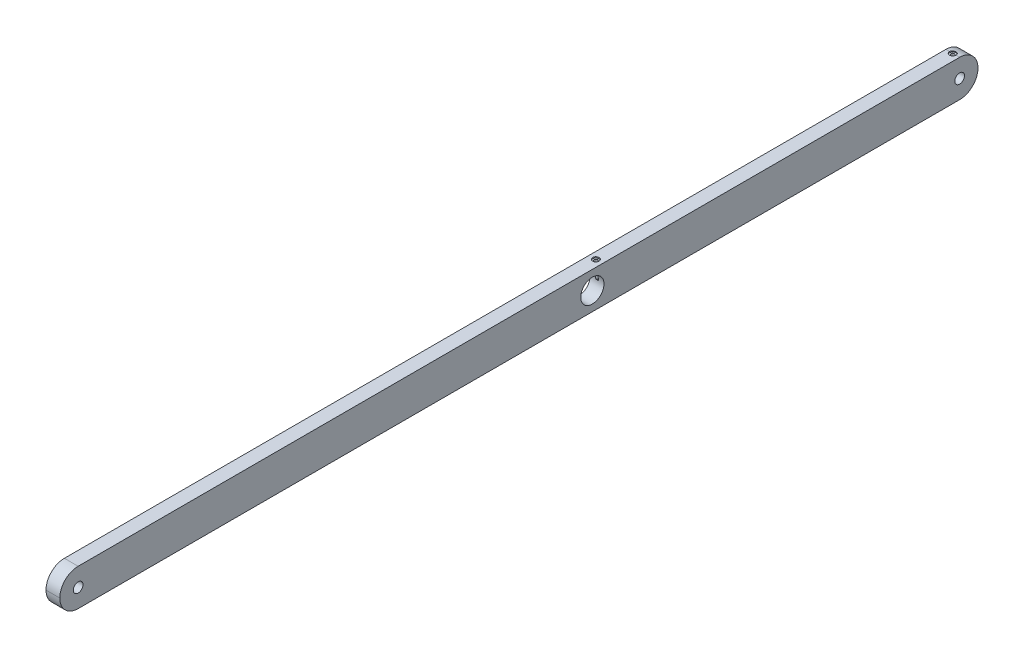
ISO-10303-21;
HEADER;
FILE_DESCRIPTION(('STEP AP214'),'2;1');
FILE_NAME('part.step','',(''),(''),'','','');
FILE_SCHEMA(('AUTOMOTIVE_DESIGN { 1 0 10303 214 1 1 1 1 }'));
ENDSEC;
DATA;
#1=APPLICATION_CONTEXT('core data for automotive mechanical design processes');
#2=APPLICATION_PROTOCOL_DEFINITION('international standard','automotive_design',2000,#1);
#3=PRODUCT_CONTEXT('',#1,'mechanical');
#4=PRODUCT('Part','Part','',(#3));
#5=PRODUCT_RELATED_PRODUCT_CATEGORY('part','',(#4));
#6=PRODUCT_DEFINITION_FORMATION('','',#4);
#7=PRODUCT_DEFINITION_CONTEXT('part definition',#1,'design');
#8=PRODUCT_DEFINITION('design','',#6,#7);
#9=PRODUCT_DEFINITION_SHAPE('','',#8);
#10=(LENGTH_UNIT() NAMED_UNIT(*) SI_UNIT(.MILLI.,.METRE.));
#11=(NAMED_UNIT(*) PLANE_ANGLE_UNIT() SI_UNIT($,.RADIAN.));
#12=(NAMED_UNIT(*) SI_UNIT($,.STERADIAN.) SOLID_ANGLE_UNIT());
#13=UNCERTAINTY_MEASURE_WITH_UNIT(LENGTH_MEASURE(1.E-05),#10,'distance_accuracy_value','');
#14=(GEOMETRIC_REPRESENTATION_CONTEXT(3) GLOBAL_UNCERTAINTY_ASSIGNED_CONTEXT((#13)) GLOBAL_UNIT_ASSIGNED_CONTEXT((#10,
#11,#12)) REPRESENTATION_CONTEXT('',''));
#15=CARTESIAN_POINT('',(0.,0.,0.));
#16=DIRECTION('',(0.,0.,1.));
#17=DIRECTION('',(1.,0.,0.));
#18=AXIS2_PLACEMENT_3D('',#15,#16,#17);
#19=CARTESIAN_POINT('',(9.525,0.,1219.2));
#20=DIRECTION('',(-1.,0.,0.));
#21=DIRECTION('',(0.,0.,1.));
#22=AXIS2_PLACEMENT_3D('',#19,#20,#21);
#23=CYLINDRICAL_SURFACE('',#22,25.4);
#24=DIRECTION('',(-1.,0.,0.));
#25=VECTOR('',#24,1.);
#26=CARTESIAN_POINT('',(9.525,0.,1244.6));
#27=LINE('',#26,#25);
#28=CARTESIAN_POINT('',(-9.525,0.,1244.6));
#29=VERTEX_POINT('',#28);
#30=CARTESIAN_POINT('',(9.525,0.,1244.6));
#31=VERTEX_POINT('',#30);
#32=EDGE_CURVE('E172',#29,#31,#27,.F.);
#33=ORIENTED_EDGE('',*,*,#32,.F.);
#34=CARTESIAN_POINT('',(-9.525,0.,1219.2));
#35=DIRECTION('',(1.,0.,0.));
#36=DIRECTION('',(0.,0.,-1.));
#37=AXIS2_PLACEMENT_3D('',#34,#35,#36);
#38=CIRCLE('',#37,25.4);
#39=CARTESIAN_POINT('',(-9.525,-25.4,1219.2));
#40=VERTEX_POINT('',#39);
#41=EDGE_CURVE('E136',#29,#40,#38,.T.);
#42=ORIENTED_EDGE('',*,*,#41,.T.);
#43=DIRECTION('',(-1.,0.,0.));
#44=VECTOR('',#43,1.);
#45=CARTESIAN_POINT('',(9.525,-25.4,1219.2));
#46=LINE('',#45,#44);
#47=CARTESIAN_POINT('',(9.525,-25.4,1219.2));
#48=VERTEX_POINT('',#47);
#49=EDGE_CURVE('E169',#48,#40,#46,.T.);
#50=ORIENTED_EDGE('',*,*,#49,.F.);
#51=CARTESIAN_POINT('',(9.525,0.,1219.2));
#52=DIRECTION('',(1.,0.,0.));
#53=DIRECTION('',(0.,0.,-1.));
#54=AXIS2_PLACEMENT_3D('',#51,#52,#53);
#55=CIRCLE('',#54,25.4);
#56=EDGE_CURVE('E143',#31,#48,#55,.T.);
#57=ORIENTED_EDGE('',*,*,#56,.F.);
#58=EDGE_LOOP('',(#33,#42,#50,#57));
#59=FACE_BOUND('',#58,.T.);
#60=ADVANCED_FACE('F36',(#59),#23,.T.);
#61=CARTESIAN_POINT('',(9.525,0.,1219.2));
#62=DIRECTION('',(1.,0.,0.));
#63=DIRECTION('',(0.,0.,-1.));
#64=AXIS2_PLACEMENT_3D('',#61,#62,#63);
#65=PLANE('',#64);
#66=CARTESIAN_POINT('',(9.525,0.,1219.2));
#67=DIRECTION('',(1.,0.,0.));
#68=DIRECTION('',(0.,0.,-1.));
#69=AXIS2_PLACEMENT_3D('',#66,#67,#68);
#70=CIRCLE('',#69,6.73100000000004);
#71=CARTESIAN_POINT('',(9.525,0.,1225.931));
#72=VERTEX_POINT('',#71);
#73=EDGE_CURVE('E127',#72,#72,#70,.T.);
#74=ORIENTED_EDGE('',*,*,#73,.F.);
#75=EDGE_LOOP('',(#74));
#76=FACE_BOUND('',#75,.T.);
#77=CARTESIAN_POINT('',(9.525,25.4,1219.2));
#78=VERTEX_POINT('',#77);
#79=EDGE_CURVE('E139',#78,#31,#55,.T.);
#80=ORIENTED_EDGE('',*,*,#79,.T.);
#81=ORIENTED_EDGE('',*,*,#56,.T.);
#82=DIRECTION('',(0.,0.,-1.));
#83=VECTOR('',#82,1.);
#84=CARTESIAN_POINT('',(9.525,-25.4,1219.2));
#85=LINE('',#84,#83);
#86=CARTESIAN_POINT('',(9.525,-25.4,0.));
#87=VERTEX_POINT('',#86);
#88=EDGE_CURVE('E142',#48,#87,#85,.T.);
#89=ORIENTED_EDGE('',*,*,#88,.T.);
#90=CARTESIAN_POINT('',(9.525,0.,0.));
#91=DIRECTION('',(1.,0.,0.));
#92=DIRECTION('',(0.,0.,-1.));
#93=AXIS2_PLACEMENT_3D('',#90,#91,#92);
#94=CIRCLE('',#93,25.4);
#95=CARTESIAN_POINT('',(9.525,25.4,0.));
#96=VERTEX_POINT('',#95);
#97=EDGE_CURVE('E145',#87,#96,#94,.T.);
#98=ORIENTED_EDGE('',*,*,#97,.T.);
#99=DIRECTION('',(0.,0.,1.));
#100=VECTOR('',#99,1.);
#101=CARTESIAN_POINT('',(9.525,25.4,1219.2));
#102=LINE('',#101,#100);
#103=EDGE_CURVE('E147',#96,#78,#102,.T.);
#104=ORIENTED_EDGE('',*,*,#103,.T.);
#105=EDGE_LOOP('',(#80,#81,#89,#98,#104));
#106=FACE_BOUND('',#105,.T.);
#107=CARTESIAN_POINT('',(9.525,0.,0.));
#108=DIRECTION('',(1.,0.,0.));
#109=DIRECTION('',(0.,0.,-1.));
#110=AXIS2_PLACEMENT_3D('',#107,#108,#109);
#111=CIRCLE('',#110,6.731);
#112=CARTESIAN_POINT('',(9.525,0.,-6.731));
#113=VERTEX_POINT('',#112);
#114=EDGE_CURVE('E133',#113,#113,#111,.T.);
#115=ORIENTED_EDGE('',*,*,#114,.F.);
#116=EDGE_LOOP('',(#115));
#117=FACE_BOUND('',#116,.T.);
#118=CARTESIAN_POINT('',(9.525,0.,508.));
#119=DIRECTION('',(1.,0.,0.));
#120=DIRECTION('',(0.,0.,-1.));
#121=AXIS2_PLACEMENT_3D('',#118,#119,#120);
#122=CIRCLE('',#121,16.0655);
#123=CARTESIAN_POINT('',(9.525,0.,491.9345));
#124=VERTEX_POINT('',#123);
#125=EDGE_CURVE('E116',#124,#124,#122,.T.);
#126=ORIENTED_EDGE('',*,*,#125,.F.);
#127=EDGE_LOOP('',(#126));
#128=FACE_BOUND('',#127,.T.);
#129=ADVANCED_FACE('F227',(#76,#106,#117,#128),#65,.T.);
#130=CARTESIAN_POINT('',(-9.525,0.,1219.2));
#131=DIRECTION('',(1.,0.,0.));
#132=DIRECTION('',(0.,0.,-1.));
#133=AXIS2_PLACEMENT_3D('',#130,#131,#132);
#134=PLANE('',#133);
#135=CARTESIAN_POINT('',(-9.525,25.4,1219.2));
#136=VERTEX_POINT('',#135);
#137=EDGE_CURVE('E150',#136,#29,#38,.T.);
#138=ORIENTED_EDGE('',*,*,#137,.F.);
#139=DIRECTION('',(0.,0.,1.));
#140=VECTOR('',#139,1.);
#141=CARTESIAN_POINT('',(-9.525,25.4,1219.2));
#142=LINE('',#141,#140);
#143=CARTESIAN_POINT('',(-9.525,25.4,0.));
#144=VERTEX_POINT('',#143);
#145=EDGE_CURVE('E158',#144,#136,#142,.T.);
#146=ORIENTED_EDGE('',*,*,#145,.F.);
#147=CARTESIAN_POINT('',(-9.525,0.,0.));
#148=DIRECTION('',(1.,0.,0.));
#149=DIRECTION('',(0.,0.,-1.));
#150=AXIS2_PLACEMENT_3D('',#147,#148,#149);
#151=CIRCLE('',#150,25.4);
#152=CARTESIAN_POINT('',(-9.525,-25.4,0.));
#153=VERTEX_POINT('',#152);
#154=EDGE_CURVE('E155',#153,#144,#151,.T.);
#155=ORIENTED_EDGE('',*,*,#154,.F.);
#156=DIRECTION('',(0.,0.,-1.));
#157=VECTOR('',#156,1.);
#158=CARTESIAN_POINT('',(-9.525,-25.4,1219.2));
#159=LINE('',#158,#157);
#160=EDGE_CURVE('E153',#40,#153,#159,.T.);
#161=ORIENTED_EDGE('',*,*,#160,.F.);
#162=ORIENTED_EDGE('',*,*,#41,.F.);
#163=EDGE_LOOP('',(#138,#146,#155,#161,#162));
#164=FACE_BOUND('',#163,.T.);
#165=CARTESIAN_POINT('',(-9.525,0.,0.));
#166=DIRECTION('',(1.,0.,0.));
#167=DIRECTION('',(0.,0.,-1.));
#168=AXIS2_PLACEMENT_3D('',#165,#166,#167);
#169=CIRCLE('',#168,6.731);
#170=CARTESIAN_POINT('',(-9.525,0.,-6.731));
#171=VERTEX_POINT('',#170);
#172=EDGE_CURVE('E130',#171,#171,#169,.T.);
#173=ORIENTED_EDGE('',*,*,#172,.T.);
#174=EDGE_LOOP('',(#173));
#175=FACE_BOUND('',#174,.T.);
#176=CARTESIAN_POINT('',(-9.525,0.,1219.2));
#177=DIRECTION('',(1.,0.,0.));
#178=DIRECTION('',(0.,0.,-1.));
#179=AXIS2_PLACEMENT_3D('',#176,#177,#178);
#180=CIRCLE('',#179,6.73100000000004);
#181=CARTESIAN_POINT('',(-9.525,0.,1225.931));
#182=VERTEX_POINT('',#181);
#183=EDGE_CURVE('E122',#182,#182,#180,.T.);
#184=ORIENTED_EDGE('',*,*,#183,.T.);
#185=EDGE_LOOP('',(#184));
#186=FACE_BOUND('',#185,.T.);
#187=CARTESIAN_POINT('',(-9.525,0.,508.));
#188=DIRECTION('',(1.,0.,0.));
#189=DIRECTION('',(0.,0.,-1.));
#190=AXIS2_PLACEMENT_3D('',#187,#188,#189);
#191=CIRCLE('',#190,16.0655);
#192=CARTESIAN_POINT('',(-9.525,0.,491.9345));
#193=VERTEX_POINT('',#192);
#194=EDGE_CURVE('E119',#193,#193,#191,.T.);
#195=ORIENTED_EDGE('',*,*,#194,.T.);
#196=EDGE_LOOP('',(#195));
#197=FACE_BOUND('',#196,.T.);
#198=ADVANCED_FACE('F224',(#164,#175,#186,#197),#134,.F.);
#199=ORIENTED_EDGE('',*,*,#137,.T.);
#200=ORIENTED_EDGE('',*,*,#32,.T.);
#201=ORIENTED_EDGE('',*,*,#79,.F.);
#202=DIRECTION('',(-1.,0.,0.));
#203=VECTOR('',#202,1.);
#204=CARTESIAN_POINT('',(9.525,25.4,1219.2));
#205=LINE('',#204,#203);
#206=EDGE_CURVE('E149',#78,#136,#205,.T.);
#207=ORIENTED_EDGE('',*,*,#206,.T.);
#208=EDGE_LOOP('',(#199,#200,#201,#207));
#209=FACE_BOUND('',#208,.T.);
#210=ADVANCED_FACE('F38',(#209),#23,.T.);
#211=CARTESIAN_POINT('',(9.525,-25.4,1219.2));
#212=DIRECTION('',(0.,1.,0.));
#213=DIRECTION('',(0.,0.,1.));
#214=AXIS2_PLACEMENT_3D('',#211,#212,#213);
#215=PLANE('',#214);
#216=ORIENTED_EDGE('',*,*,#160,.T.);
#217=DIRECTION('',(-1.,0.,0.));
#218=VECTOR('',#217,1.);
#219=CARTESIAN_POINT('',(9.525,-25.4,0.));
#220=LINE('',#219,#218);
#221=EDGE_CURVE('E166',#87,#153,#220,.T.);
#222=ORIENTED_EDGE('',*,*,#221,.F.);
#223=ORIENTED_EDGE('',*,*,#88,.F.);
#224=ORIENTED_EDGE('',*,*,#49,.T.);
#225=EDGE_LOOP('',(#216,#222,#223,#224));
#226=FACE_BOUND('',#225,.T.);
#227=ADVANCED_FACE('F216',(#226),#215,.F.);
#228=CARTESIAN_POINT('',(9.525,0.,0.));
#229=DIRECTION('',(-1.,0.,0.));
#230=DIRECTION('',(0.,0.,1.));
#231=AXIS2_PLACEMENT_3D('',#228,#229,#230);
#232=CYLINDRICAL_SURFACE('',#231,25.4);
#233=DIRECTION('',(-1.,0.,0.));
#234=VECTOR('',#233,1.);
#235=CARTESIAN_POINT('',(9.525,25.4,0.));
#236=LINE('',#235,#234);
#237=CARTESIAN_POINT('',(-4.44499999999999,25.4,0.));
#238=VERTEX_POINT('',#237);
#239=EDGE_CURVE('E162',#238,#144,#236,.T.);
#240=ORIENTED_EDGE('',*,*,#239,.F.);
#241=CARTESIAN_POINT('',(-4.44499999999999,25.4,0.));
#242=CARTESIAN_POINT('',(-4.44501446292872,25.4000090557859,-0.124011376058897));
#243=CARTESIAN_POINT('',(-4.43981092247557,25.3990921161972,-0.248019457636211));
#244=CARTESIAN_POINT('',(-4.41907323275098,25.3954718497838,-0.495130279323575));
#245=CARTESIAN_POINT('',(-4.40354014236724,25.3927687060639,-0.618233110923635));
#246=CARTESIAN_POINT('',(-4.36227577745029,25.3856462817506,-0.862500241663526));
#247=CARTESIAN_POINT('',(-4.33655789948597,25.3812292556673,-0.983666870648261));
#248=CARTESIAN_POINT('',(-4.27512586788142,25.3708051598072,-1.22336794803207));
#249=CARTESIAN_POINT('',(-4.23941172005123,25.3647980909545,-1.34190239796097));
#250=CARTESIAN_POINT('',(-4.15825491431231,25.3513601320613,-1.57550999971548));
#251=CARTESIAN_POINT('',(-4.11281215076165,25.3439292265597,-1.69058311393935));
#252=CARTESIAN_POINT('',(-4.01251572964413,25.3278464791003,-1.91651361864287));
#253=CARTESIAN_POINT('',(-3.95765859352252,25.3191941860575,-2.02736943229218));
#254=CARTESIAN_POINT('',(-3.83896126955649,25.3009123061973,-2.24402597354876));
#255=CARTESIAN_POINT('',(-3.77512430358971,25.2912830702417,-2.34982849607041));
#256=CARTESIAN_POINT('',(-3.638879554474,25.2713054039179,-2.55574453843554));
#257=CARTESIAN_POINT('',(-3.56646858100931,25.2609567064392,-2.65585592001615));
#258=CARTESIAN_POINT('',(-3.41290204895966,25.2397315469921,-2.85054823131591));
#259=CARTESIAN_POINT('',(-3.33167424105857,25.228851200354,-2.94507185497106));
#260=CARTESIAN_POINT('',(-3.16157898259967,25.2069519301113,-3.12697578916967));
#261=CARTESIAN_POINT('',(-3.07270871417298,25.1959329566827,-3.21435344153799));
#262=CARTESIAN_POINT('',(-2.79554838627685,25.1631381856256,-3.46479379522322));
#263=CARTESIAN_POINT('',(-2.59656789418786,25.1416042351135,-3.61634221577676));
#264=CARTESIAN_POINT('',(-2.17447752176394,25.1015124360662,-3.88493965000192));
#265=CARTESIAN_POINT('',(-1.95121254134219,25.0829758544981,-4.00174668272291));
#266=CARTESIAN_POINT('',(-1.48783559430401,25.0511936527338,-4.19612181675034));
#267=CARTESIAN_POINT('',(-1.24772584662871,25.0379473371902,-4.27369507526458));
#268=CARTESIAN_POINT('',(-0.760065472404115,25.0184120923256,-4.38660978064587));
#269=CARTESIAN_POINT('',(-0.512614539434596,25.0120542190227,-4.42237001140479));
#270=CARTESIAN_POINT('',(-0.0151409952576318,25.0068064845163,-4.45195103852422));
#271=CARTESIAN_POINT('',(0.234881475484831,25.0079162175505,-4.44577411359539));
#272=CARTESIAN_POINT('',(0.727377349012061,25.0174157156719,-4.39199515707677));
#273=CARTESIAN_POINT('',(0.969904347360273,25.0257222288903,-4.34486683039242));
#274=CARTESIAN_POINT('',(1.44355951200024,25.0485496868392,-4.21125917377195));
#275=CARTESIAN_POINT('',(1.67468732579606,25.0630708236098,-4.12477862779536));
#276=CARTESIAN_POINT('',(2.12036537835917,25.0967768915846,-3.91447986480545));
#277=CARTESIAN_POINT('',(2.33482144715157,25.1159860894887,-3.79046653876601));
#278=CARTESIAN_POINT('',(2.74013392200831,25.1568999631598,-3.50863806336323));
#279=CARTESIAN_POINT('',(2.93098908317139,25.1786047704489,-3.3508211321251));
#280=CARTESIAN_POINT('',(3.19674527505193,25.2113711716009,-3.09104311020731));
#281=CARTESIAN_POINT('',(3.28244796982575,25.2224080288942,-2.9998699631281));
#282=CARTESIAN_POINT('',(3.44587527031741,25.2441971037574,-2.81061765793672));
#283=CARTESIAN_POINT('',(3.52360275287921,25.2549494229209,-2.71254101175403));
#284=CARTESIAN_POINT('',(3.67058273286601,25.2758748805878,-2.51008239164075));
#285=CARTESIAN_POINT('',(3.73982961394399,25.2860476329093,-2.40569630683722));
#286=CARTESIAN_POINT('',(3.86927765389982,25.305517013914,-2.19143177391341));
#287=CARTESIAN_POINT('',(3.92948223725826,25.3148139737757,-2.08155542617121));
#288=CARTESIAN_POINT('',(4.0405423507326,25.3322905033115,-1.85682090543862));
#289=CARTESIAN_POINT('',(4.0913793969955,25.3404678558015,-1.74195342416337));
#290=CARTESIAN_POINT('',(4.18315922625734,25.3554480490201,-1.50829434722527));
#291=CARTESIAN_POINT('',(4.22410583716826,25.3622514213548,-1.38950429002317));
#292=CARTESIAN_POINT('',(4.29577694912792,25.3742867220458,-1.14893958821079));
#293=CARTESIAN_POINT('',(4.32651213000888,25.3795202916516,-1.02716820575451));
#294=CARTESIAN_POINT('',(4.37756719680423,25.3882736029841,-0.781450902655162));
#295=CARTESIAN_POINT('',(4.39789205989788,25.391794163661,-0.657506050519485));
#296=CARTESIAN_POINT('',(4.42362070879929,25.3962651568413,-0.44446231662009));
#297=CARTESIAN_POINT('',(4.43164212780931,25.3976648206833,-0.3556799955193));
#298=CARTESIAN_POINT('',(4.44232854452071,25.3995324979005,-0.177934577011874));
#299=CARTESIAN_POINT('',(4.44500257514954,25.4000020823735,-0.0889720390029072));
#300=CARTESIAN_POINT('',(4.44500000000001,25.4,0.));
#301=B_SPLINE_CURVE_WITH_KNOTS('',3,(#241,#242,#243,#244,#245,#246,#247,#248,#249,#250,#251,
#252,#253,#254,#255,#256,#257,#258,#259,#260,#261,#262,#263,#264,#265,#266,#267,#268,#269,#270,
#271,#272,#273,#274,#275,#276,#277,#278,#279,#280,#281,#282,#283,#284,#285,#286,#287,#288,#289,
#290,#291,#292,#293,#294,#295,#296,#297,#298,#299,#300),.UNSPECIFIED.,.F.,.F.,(4,2,2,2,2,2,2,2,
2,2,2,2,2,2,2,2,2,2,2,2,2,2,2,2,2,2,2,2,2,4),(0.,0.371916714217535,0.743795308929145,
1.11518636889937,1.48657721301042,1.85797209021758,2.22950449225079,2.60090393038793,
2.97244199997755,3.34729464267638,3.72228609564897,4.47159295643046,5.22600283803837,
5.98031352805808,6.72700278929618,7.4736514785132,8.21177659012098,8.94992451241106,
9.69197749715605,10.4340696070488,10.8105512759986,11.1868966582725,11.5634899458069,
11.9399402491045,12.3171255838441,12.6941647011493,13.0708082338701,13.4472715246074,
13.7145794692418,13.9814354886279),.UNSPECIFIED.);
#302=CARTESIAN_POINT('',(4.445,25.4,0.));
#303=VERTEX_POINT('',#302);
#304=EDGE_CURVE('E62',#238,#303,#301,.T.);
#305=ORIENTED_EDGE('',*,*,#304,.T.);
#306=EDGE_CURVE('E163',#96,#303,#236,.T.);
#307=ORIENTED_EDGE('',*,*,#306,.F.);
#308=ORIENTED_EDGE('',*,*,#97,.F.);
#309=ORIENTED_EDGE('',*,*,#221,.T.);
#310=ORIENTED_EDGE('',*,*,#154,.T.);
#311=EDGE_LOOP('',(#240,#305,#307,#308,#309,#310));
#312=FACE_BOUND('',#311,.T.);
#313=ADVANCED_FACE('F211',(#312),#232,.T.);
#314=CARTESIAN_POINT('',(9.525,25.4,1219.2));
#315=DIRECTION('',(0.,-1.,0.));
#316=DIRECTION('',(0.,0.,-1.));
#317=AXIS2_PLACEMENT_3D('',#314,#315,#316);
#318=PLANE('',#317);
#319=CARTESIAN_POINT('',(0.,25.4,493.522));
#320=DIRECTION('',(0.,1.,0.));
#321=DIRECTION('',(0.,0.,1.));
#322=AXIS2_PLACEMENT_3D('',#319,#320,#321);
#323=CIRCLE('',#322,4.44499999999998);
#324=CARTESIAN_POINT('',(0.,25.4,497.967));
#325=VERTEX_POINT('',#324);
#326=EDGE_CURVE('E105',#325,#325,#323,.T.);
#327=ORIENTED_EDGE('',*,*,#326,.F.);
#328=EDGE_LOOP('',(#327));
#329=FACE_BOUND('',#328,.T.);
#330=ORIENTED_EDGE('',*,*,#306,.T.);
#331=CARTESIAN_POINT('',(0.,25.4,0.));
#332=DIRECTION('',(0.,-1.,0.));
#333=DIRECTION('',(0.,0.,-1.));
#334=AXIS2_PLACEMENT_3D('',#331,#332,#333);
#335=CIRCLE('',#334,4.445);
#336=EDGE_CURVE('E101',#303,#238,#335,.T.);
#337=ORIENTED_EDGE('',*,*,#336,.T.);
#338=ORIENTED_EDGE('',*,*,#239,.T.);
#339=ORIENTED_EDGE('',*,*,#145,.T.);
#340=ORIENTED_EDGE('',*,*,#206,.F.);
#341=ORIENTED_EDGE('',*,*,#103,.F.);
#342=EDGE_LOOP('',(#330,#337,#338,#339,#340,#341));
#343=FACE_BOUND('',#342,.T.);
#344=ADVANCED_FACE('F215',(#329,#343),#318,.F.);
#345=CARTESIAN_POINT('',(9.525,0.,0.));
#346=DIRECTION('',(-1.,0.,0.));
#347=DIRECTION('',(0.,0.,1.));
#348=AXIS2_PLACEMENT_3D('',#345,#346,#347);
#349=CYLINDRICAL_SURFACE('',#348,6.731);
#350=CARTESIAN_POINT('',(0.,6.29571357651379,2.38125));
#351=CARTESIAN_POINT('',(-0.129179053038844,6.29571146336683,2.3812524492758));
#352=CARTESIAN_POINT('',(-0.258341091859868,6.29973277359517,2.37070306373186));
#353=CARTESIAN_POINT('',(-0.512805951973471,6.3152862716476,2.32894995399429));
#354=CARTESIAN_POINT('',(-0.638108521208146,6.32681894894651,2.29774488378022));
#355=CARTESIAN_POINT('',(-0.881119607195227,6.35592885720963,2.2159401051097));
#356=CARTESIAN_POINT('',(-0.998843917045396,6.37349300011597,2.1653823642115));
#357=CARTESIAN_POINT('',(-1.22418215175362,6.41266680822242,2.0464535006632));
#358=CARTESIAN_POINT('',(-1.33179342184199,6.43427753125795,1.97807771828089));
#359=CARTESIAN_POINT('',(-1.53860105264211,6.48017891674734,1.82222064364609));
#360=CARTESIAN_POINT('',(-1.63728679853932,6.50454230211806,1.73408305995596));
#361=CARTESIAN_POINT('',(-1.81883063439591,6.55259312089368,1.54260101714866));
#362=CARTESIAN_POINT('',(-1.90168580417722,6.5762804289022,1.43925375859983));
#363=CARTESIAN_POINT('',(-2.05160087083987,6.62116281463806,1.21648450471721));
#364=CARTESIAN_POINT('',(-2.11811621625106,6.64226253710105,1.09667512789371));
#365=CARTESIAN_POINT('',(-2.22984123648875,6.67872735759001,0.846691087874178));
#366=CARTESIAN_POINT('',(-2.27505743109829,6.69409421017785,0.716519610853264));
#367=CARTESIAN_POINT('',(-2.34114096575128,6.71684625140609,0.454867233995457));
#368=CARTESIAN_POINT('',(-2.36288509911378,6.72451803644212,0.323633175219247));
#369=CARTESIAN_POINT('',(-2.38420540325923,6.73203820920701,0.0591696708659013));
#370=CARTESIAN_POINT('',(-2.38378799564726,6.73188886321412,-0.0740591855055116));
#371=CARTESIAN_POINT('',(-2.36133155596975,6.72397216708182,-0.332487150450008));
#372=CARTESIAN_POINT('',(-2.34024701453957,6.71654111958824,-0.457781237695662));
#373=CARTESIAN_POINT('',(-2.27864616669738,6.69532720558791,-0.702922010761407));
#374=CARTESIAN_POINT('',(-2.23812850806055,6.68154389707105,-0.822768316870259));
#375=CARTESIAN_POINT('',(-2.13830993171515,6.64876933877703,-1.05558096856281));
#376=CARTESIAN_POINT('',(-2.07875557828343,6.62970831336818,-1.16842842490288));
#377=CARTESIAN_POINT('',(-1.94276983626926,6.5883363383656,-1.38279473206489));
#378=CARTESIAN_POINT('',(-1.86633336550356,6.56602441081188,-1.48431015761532));
#379=CARTESIAN_POINT('',(-1.69404206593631,6.51909286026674,-1.67878596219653));
#380=CARTESIAN_POINT('',(-1.59737733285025,6.49441358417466,-1.7710155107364));
#381=CARTESIAN_POINT('',(-1.3897701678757,6.44649395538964,-1.93821029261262));
#382=CARTESIAN_POINT('',(-1.27882492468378,6.42325388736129,-2.0131721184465));
#383=CARTESIAN_POINT('',(-1.0432224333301,6.38049316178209,-2.14489325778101));
#384=CARTESIAN_POINT('',(-0.918355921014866,6.36104623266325,-2.20130408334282));
#385=CARTESIAN_POINT('',(-0.660030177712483,6.32892383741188,-2.29203583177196));
#386=CARTESIAN_POINT('',(-0.526575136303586,6.31624509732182,-2.32636743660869));
#387=CARTESIAN_POINT('',(-0.262012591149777,6.29985026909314,-2.37039557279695));
#388=CARTESIAN_POINT('',(-0.131121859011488,6.29571738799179,-2.38123901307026));
#389=CARTESIAN_POINT('',(0.130645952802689,6.295709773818,-2.38126096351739));
#390=CARTESIAN_POINT('',(0.261523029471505,6.2998332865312,-2.3704440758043));
#391=CARTESIAN_POINT('',(0.514023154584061,6.31545448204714,-2.3284878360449));
#392=CARTESIAN_POINT('',(0.635806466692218,6.32664759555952,-2.29818695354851));
#393=CARTESIAN_POINT('',(0.872521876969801,6.35479917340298,-2.21915207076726));
#394=CARTESIAN_POINT('',(0.987452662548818,6.37175873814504,-2.17041455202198));
#395=CARTESIAN_POINT('',(1.21161722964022,6.41025717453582,-2.05398085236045));
#396=CARTESIAN_POINT('',(1.32051602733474,6.43193425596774,-1.9856867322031));
#397=CARTESIAN_POINT('',(1.52571929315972,6.47717466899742,-1.83273581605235));
#398=CARTESIAN_POINT('',(1.622019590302,6.50073862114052,-1.74807362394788));
#399=CARTESIAN_POINT('',(1.80480394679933,6.54867261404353,-1.55924188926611));
#400=CARTESIAN_POINT('',(1.89045116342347,6.57301521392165,-1.45425273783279));
#401=CARTESIAN_POINT('',(2.04298817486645,6.61849655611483,-1.23079125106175));
#402=CARTESIAN_POINT('',(2.10987834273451,6.63963536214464,-1.11231918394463));
#403=CARTESIAN_POINT('',(2.22245441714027,6.6762628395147,-0.865634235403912));
#404=CARTESIAN_POINT('',(2.26825266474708,6.69178134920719,-0.737477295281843));
#405=CARTESIAN_POINT('',(2.33742227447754,6.71554050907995,-0.474613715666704));
#406=CARTESIAN_POINT('',(2.36080288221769,6.72378415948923,-0.339909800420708));
#407=CARTESIAN_POINT('',(2.38356080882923,6.73181034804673,-0.0753849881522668));
#408=CARTESIAN_POINT('',(2.38413302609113,6.73201407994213,0.0543213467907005));
#409=CARTESIAN_POINT('',(2.36426567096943,6.72500371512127,0.311897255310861));
#410=CARTESIAN_POINT('',(2.34382818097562,6.71779035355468,0.439767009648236));
#411=CARTESIAN_POINT('',(2.28333993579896,6.69692998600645,0.687498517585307));
#412=CARTESIAN_POINT('',(2.24368460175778,6.68341288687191,0.807468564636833));
#413=CARTESIAN_POINT('',(2.14626459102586,6.65134214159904,1.03908290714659));
#414=CARTESIAN_POINT('',(2.08849653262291,6.63278755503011,1.15072564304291));
#415=CARTESIAN_POINT('',(1.95386894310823,6.59161227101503,1.36735145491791));
#416=CARTESIAN_POINT('',(1.87634342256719,6.56885955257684,1.47189513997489));
#417=CARTESIAN_POINT('',(1.70549359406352,6.52211421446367,1.66687051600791));
#418=CARTESIAN_POINT('',(1.61216393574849,6.4981211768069,1.75729740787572));
#419=CARTESIAN_POINT('',(1.40728143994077,6.45027911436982,1.92568917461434));
#420=CARTESIAN_POINT('',(1.29509182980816,6.42648651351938,2.00289804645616));
#421=CARTESIAN_POINT('',(1.05857704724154,6.38303318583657,2.13734941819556));
#422=CARTESIAN_POINT('',(0.934253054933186,6.36337205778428,2.19459385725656));
#423=CARTESIAN_POINT('',(0.67721342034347,6.33075499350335,2.28698870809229));
#424=CARTESIAN_POINT('',(0.54452487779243,6.31777853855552,2.32220680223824));
#425=CARTESIAN_POINT('',(0.27454967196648,6.30026096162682,2.3693305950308));
#426=CARTESIAN_POINT('',(0.137265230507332,6.29571582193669,2.38124739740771));
#427=CARTESIAN_POINT('',(0.,6.29571357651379,2.38125));
#428=B_SPLINE_CURVE_WITH_KNOTS('',3,(#350,#351,#352,#353,#354,#355,#356,#357,#358,#359,#360,
#361,#362,#363,#364,#365,#366,#367,#368,#369,#370,#371,#372,#373,#374,#375,#376,#377,#378,#379,
#380,#381,#382,#383,#384,#385,#386,#387,#388,#389,#390,#391,#392,#393,#394,#395,#396,#397,#398,
#399,#400,#401,#402,#403,#404,#405,#406,#407,#408,#409,#410,#411,#412,#413,#414,#415,#416,#417,
#418,#419,#420,#421,#422,#423,#424,#425,#426,#427),.UNSPECIFIED.,.T.,.F.,(4,2,2,2,2,2,2,2,2,2,2,
2,2,2,2,2,2,2,2,2,2,2,2,2,2,2,2,2,2,2,2,2,2,2,2,2,2,2,4),(0.,0.387027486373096,
0.774080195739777,1.1602982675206,1.54661744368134,1.94843112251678,2.35031885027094,
2.76418813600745,3.17793065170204,3.57561741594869,3.97318894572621,4.35322453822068,
4.73328657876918,5.1186352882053,5.50410016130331,5.90983980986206,6.31565945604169,
6.72871692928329,7.14157441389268,7.53376985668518,7.92588197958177,8.30215671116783,
8.67850328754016,9.0678790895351,9.45738347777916,9.8684181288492,10.2794446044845,
10.6882557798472,11.0968982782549,11.4841028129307,11.8712689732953,12.2507869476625,
12.6303758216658,13.0250109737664,13.4197799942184,13.8325448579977,14.2452696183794,
14.6567198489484,15.0679739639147),.UNSPECIFIED.);
#429=CARTESIAN_POINT('',(0.,6.29571357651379,2.38125));
#430=VERTEX_POINT('',#429);
#431=EDGE_CURVE('E176',#430,#430,#428,.T.);
#432=ORIENTED_EDGE('',*,*,#431,.F.);
#433=EDGE_LOOP('',(#432));
#434=FACE_BOUND('',#433,.T.);
#435=ORIENTED_EDGE('',*,*,#114,.T.);
#436=EDGE_LOOP('',(#435));
#437=FACE_BOUND('',#436,.T.);
#438=ORIENTED_EDGE('',*,*,#172,.F.);
#439=EDGE_LOOP('',(#438));
#440=FACE_BOUND('',#439,.T.);
#441=ADVANCED_FACE('F184',(#434,#437,#440),#349,.F.);
#442=CARTESIAN_POINT('',(9.525,0.,1219.2));
#443=DIRECTION('',(-1.,0.,0.));
#444=DIRECTION('',(0.,0.,1.));
#445=AXIS2_PLACEMENT_3D('',#442,#443,#444);
#446=CYLINDRICAL_SURFACE('',#445,6.73100000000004);
#447=CARTESIAN_POINT('',(9.525,0.,1225.931));
#448=CARTESIAN_POINT('',(9.3265625,0.,1225.931));
#449=CARTESIAN_POINT('',(9.128125,0.,1225.931));
#450=CARTESIAN_POINT('',(8.73125,0.,1225.931));
#451=CARTESIAN_POINT('',(8.5328125,0.,1225.931));
#452=CARTESIAN_POINT('',(8.1359375,0.,1225.931));
#453=CARTESIAN_POINT('',(7.9375,0.,1225.931));
#454=CARTESIAN_POINT('',(7.540625,0.,1225.931));
#455=CARTESIAN_POINT('',(7.3421875,0.,1225.931));
#456=CARTESIAN_POINT('',(6.9453125,0.,1225.931));
#457=CARTESIAN_POINT('',(6.746875,0.,1225.931));
#458=CARTESIAN_POINT('',(6.35,0.,1225.931));
#459=CARTESIAN_POINT('',(6.1515625,0.,1225.931));
#460=CARTESIAN_POINT('',(5.7546875,0.,1225.931));
#461=CARTESIAN_POINT('',(5.55625,0.,1225.931));
#462=CARTESIAN_POINT('',(5.159375,0.,1225.931));
#463=CARTESIAN_POINT('',(4.9609375,0.,1225.931));
#464=CARTESIAN_POINT('',(4.5640625,0.,1225.931));
#465=CARTESIAN_POINT('',(4.365625,0.,1225.931));
#466=CARTESIAN_POINT('',(3.96875,0.,1225.931));
#467=CARTESIAN_POINT('',(3.7703125,0.,1225.931));
#468=CARTESIAN_POINT('',(3.3734375,0.,1225.931));
#469=CARTESIAN_POINT('',(3.175,0.,1225.931));
#470=CARTESIAN_POINT('',(2.778125,0.,1225.931));
#471=CARTESIAN_POINT('',(2.5796875,0.,1225.931));
#472=CARTESIAN_POINT('',(2.1828125,0.,1225.931));
#473=CARTESIAN_POINT('',(1.984375,0.,1225.931));
#474=CARTESIAN_POINT('',(1.5875,0.,1225.931));
#475=CARTESIAN_POINT('',(1.3890625,0.,1225.931));
#476=CARTESIAN_POINT('',(0.992187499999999,0.,1225.931));
#477=CARTESIAN_POINT('',(0.793749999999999,0.,1225.931));
#478=CARTESIAN_POINT('',(0.396874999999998,0.,1225.931));
#479=CARTESIAN_POINT('',(0.198437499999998,0.,1225.931));
#480=CARTESIAN_POINT('',(-0.198437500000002,0.,1225.931));
#481=CARTESIAN_POINT('',(-0.396875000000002,0.,1225.931));
#482=CARTESIAN_POINT('',(-0.793750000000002,0.,1225.931));
#483=CARTESIAN_POINT('',(-0.992187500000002,0.,1225.931));
#484=CARTESIAN_POINT('',(-1.3890625,0.,1225.931));
#485=CARTESIAN_POINT('',(-1.5875,0.,1225.931));
#486=CARTESIAN_POINT('',(-1.984375,0.,1225.931));
#487=CARTESIAN_POINT('',(-2.1828125,0.,1225.931));
#488=CARTESIAN_POINT('',(-2.5796875,0.,1225.931));
#489=CARTESIAN_POINT('',(-2.778125,0.,1225.931));
#490=CARTESIAN_POINT('',(-3.175,0.,1225.931));
#491=CARTESIAN_POINT('',(-3.3734375,0.,1225.931));
#492=CARTESIAN_POINT('',(-3.7703125,0.,1225.931));
#493=CARTESIAN_POINT('',(-3.96875,0.,1225.931));
#494=CARTESIAN_POINT('',(-4.365625,0.,1225.931));
#495=CARTESIAN_POINT('',(-4.5640625,0.,1225.931));
#496=CARTESIAN_POINT('',(-4.9609375,0.,1225.931));
#497=CARTESIAN_POINT('',(-5.159375,0.,1225.931));
#498=CARTESIAN_POINT('',(-5.55625,0.,1225.931));
#499=CARTESIAN_POINT('',(-5.7546875,0.,1225.931));
#500=CARTESIAN_POINT('',(-6.1515625,0.,1225.931));
#501=CARTESIAN_POINT('',(-6.35,0.,1225.931));
#502=CARTESIAN_POINT('',(-6.746875,0.,1225.931));
#503=CARTESIAN_POINT('',(-6.9453125,0.,1225.931));
#504=CARTESIAN_POINT('',(-7.3421875,0.,1225.931));
#505=CARTESIAN_POINT('',(-7.540625,0.,1225.931));
#506=CARTESIAN_POINT('',(-7.9375,0.,1225.931));
#507=CARTESIAN_POINT('',(-8.1359375,0.,1225.931));
#508=CARTESIAN_POINT('',(-8.5328125,0.,1225.931));
#509=CARTESIAN_POINT('',(-8.73125,0.,1225.931));
#510=CARTESIAN_POINT('',(-9.128125,0.,1225.931));
#511=CARTESIAN_POINT('',(-9.3265625,0.,1225.931));
#512=CARTESIAN_POINT('',(-9.525,0.,1225.931));
#513=B_SPLINE_CURVE_WITH_KNOTS('',3,(#447,#448,#449,#450,#451,#452,#453,#454,#455,#456,#457,
#458,#459,#460,#461,#462,#463,#464,#465,#466,#467,#468,#469,#470,#471,#472,#473,#474,#475,#476,
#477,#478,#479,#480,#481,#482,#483,#484,#485,#486,#487,#488,#489,#490,#491,#492,#493,#494,#495,
#496,#497,#498,#499,#500,#501,#502,#503,#504,#505,#506,#507,#508,#509,#510,#511,#512),
.UNSPECIFIED.,.F.,.F.,(4,2,2,2,2,2,2,2,2,2,2,2,2,2,2,2,2,2,2,2,2,2,2,2,2,2,2,2,2,2,2,2,4),(0.,
0.595312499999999,1.190625,1.7859375,2.38125,2.9765625,3.571875,4.1671875,4.7625,5.3578125,
5.953125,6.5484375,7.14375,7.7390625,8.334375,8.9296875,9.525,10.1203125,10.715625,11.3109375,
11.90625,12.5015625,13.096875,13.6921875,14.2875,14.8828125,15.478125,16.0734375,16.66875,
17.2640625,17.859375,18.4546875,19.05),.UNSPECIFIED.);
#514=EDGE_CURVE('BSEAM112',#72,#182,#513,.T.);
#515=ORIENTED_EDGE('',*,*,#73,.T.);
#516=ORIENTED_EDGE('',*,*,#183,.F.);
#517=ORIENTED_EDGE('',*,*,#514,.T.);
#518=ORIENTED_EDGE('',*,*,#514,.F.);
#519=EDGE_LOOP('',(#515,#517,#516,#518));
#520=FACE_BOUND('',#519,.T.);
#521=ADVANCED_FACE('F112',(#520),#446,.F.);
#522=CARTESIAN_POINT('',(9.525,0.,508.));
#523=DIRECTION('',(-1.,0.,0.));
#524=DIRECTION('',(0.,0.,1.));
#525=AXIS2_PLACEMENT_3D('',#522,#523,#524);
#526=CYLINDRICAL_SURFACE('',#525,16.0655);
#527=CARTESIAN_POINT('',(1.77487895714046,0.,491.9345));
#528=CARTESIAN_POINT('',(1.77481742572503,0.181937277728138,491.934495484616));
#529=CARTESIAN_POINT('',(1.77764231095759,0.363859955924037,491.937590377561));
#530=CARTESIAN_POINT('',(1.78860485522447,0.727281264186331,491.949942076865));
#531=CARTESIAN_POINT('',(1.79674086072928,0.908780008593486,491.95919696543));
#532=CARTESIAN_POINT('',(1.81784808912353,1.27076305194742,491.983810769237));
#533=CARTESIAN_POINT('',(1.83081103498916,1.45124855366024,491.999159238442));
#534=CARTESIAN_POINT('',(1.86076166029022,1.81126769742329,492.035904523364));
#535=CARTESIAN_POINT('',(1.87774964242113,1.99080126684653,492.057301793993));
#536=CARTESIAN_POINT('',(1.93366077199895,2.5308035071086,492.130907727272));
#537=CARTESIAN_POINT('',(1.97731905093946,2.88955783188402,492.19231814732));
#538=CARTESIAN_POINT('',(2.06852197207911,3.60164126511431,492.339197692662));
#539=CARTESIAN_POINT('',(2.11606772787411,3.95496878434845,492.42467372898));
#540=CARTESIAN_POINT('',(2.19913536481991,4.60038937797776,492.604205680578));
#541=CARTESIAN_POINT('',(2.23537118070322,4.89335548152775,492.694785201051));
#542=CARTESIAN_POINT('',(2.29901210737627,5.47457129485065,492.892926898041));
#543=CARTESIAN_POINT('',(2.32641556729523,5.76282011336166,493.000492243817));
#544=CARTESIAN_POINT('',(2.3664393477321,6.33253410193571,493.232015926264));
#545=CARTESIAN_POINT('',(2.37911844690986,6.61402182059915,493.355906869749));
#546=CARTESIAN_POINT('',(2.38194669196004,7.03052814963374,493.553699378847));
#547=CARTESIAN_POINT('',(2.3801942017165,7.16836599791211,493.621599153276));
#548=CARTESIAN_POINT('',(2.37023813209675,7.44184143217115,493.761220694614));
#549=CARTESIAN_POINT('',(2.36203602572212,7.5774795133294,493.832941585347));
#550=CARTESIAN_POINT('',(2.33792163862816,7.8468662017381,493.980346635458));
#551=CARTESIAN_POINT('',(2.32196805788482,7.98060069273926,494.056050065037));
#552=CARTESIAN_POINT('',(2.28091434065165,8.24476877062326,494.210602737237));
#553=CARTESIAN_POINT('',(2.25581809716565,8.37520373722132,494.28945062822));
#554=CARTESIAN_POINT('',(2.19488453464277,8.6316492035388,494.449439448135));
#555=CARTESIAN_POINT('',(2.15907612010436,8.75767060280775,494.530573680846));
#556=CARTESIAN_POINT('',(2.07477238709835,9.00437802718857,494.694236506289));
#557=CARTESIAN_POINT('',(2.02628792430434,9.12506851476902,494.776763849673));
#558=CARTESIAN_POINT('',(1.9139025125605,9.36051763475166,494.942363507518));
#559=CARTESIAN_POINT('',(1.84987677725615,9.47521862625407,495.025434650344));
#560=CARTESIAN_POINT('',(1.70406017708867,9.69506945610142,495.188886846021));
#561=CARTESIAN_POINT('',(1.62227567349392,9.80022269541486,495.269268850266));
#562=CARTESIAN_POINT('',(1.45352989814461,9.98118567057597,495.410829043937));
#563=CARTESIAN_POINT('',(1.3695728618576,10.0589865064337,495.473004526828));
#564=CARTESIAN_POINT('',(1.18671347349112,10.2021271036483,495.589304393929));
#565=CARTESIAN_POINT('',(1.08783652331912,10.2674876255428,495.64344215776));
#566=CARTESIAN_POINT('',(0.900699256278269,10.3684521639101,495.728130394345));
#567=CARTESIAN_POINT('',(0.815430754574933,10.4074386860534,495.761232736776));
#568=CARTESIAN_POINT('',(0.637618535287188,10.4740492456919,495.81818940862));
#569=CARTESIAN_POINT('',(0.545079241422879,10.5016801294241,495.842049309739));
#570=CARTESIAN_POINT('',(0.354264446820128,10.5440386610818,495.878764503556));
#571=CARTESIAN_POINT('',(0.255955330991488,10.5586805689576,495.891546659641));
#572=CARTESIAN_POINT('',(0.0574326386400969,10.5736679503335,495.904631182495));
#573=CARTESIAN_POINT('',(-0.0427801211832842,10.5740194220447,495.904938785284));
#574=CARTESIAN_POINT('',(-0.231108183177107,10.5611358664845,495.89368982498));
#575=CARTESIAN_POINT('',(-0.319400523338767,10.5493056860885,495.883360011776));
#576=CARTESIAN_POINT('',(-0.492212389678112,10.5148804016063,495.853473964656));
#577=CARTESIAN_POINT('',(-0.576731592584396,10.4922843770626,495.833916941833));
#578=CARTESIAN_POINT('',(-0.74277901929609,10.4366330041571,495.786140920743));
#579=CARTESIAN_POINT('',(-0.82413029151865,10.4032718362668,495.757669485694));
#580=CARTESIAN_POINT('',(-0.979794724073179,10.3278404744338,495.693967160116));
#581=CARTESIAN_POINT('',(-1.0541044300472,10.2857660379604,495.658732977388));
#582=CARTESIAN_POINT('',(-1.23348125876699,10.1695647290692,495.562615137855));
#583=CARTESIAN_POINT('',(-1.33340025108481,10.0904224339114,495.498177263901));
#584=CARTESIAN_POINT('',(-1.51584500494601,9.91933688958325,495.361999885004));
#585=CARTESIAN_POINT('',(-1.59832653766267,9.82736204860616,495.290242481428));
#586=CARTESIAN_POINT('',(-1.72974117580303,9.65694247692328,495.160514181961));
#587=CARTESIAN_POINT('',(-1.78199684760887,9.58043264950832,495.103289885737));
#588=CARTESIAN_POINT('',(-1.87813223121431,9.42299933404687,494.987817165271));
#589=CARTESIAN_POINT('',(-1.92200736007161,9.3420734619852,494.929568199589));
#590=CARTESIAN_POINT('',(-2.00225600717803,9.1766078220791,494.812868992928));
#591=CARTESIAN_POINT('',(-2.03862123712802,9.09206418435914,494.754418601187));
#592=CARTESIAN_POINT('',(-2.10461797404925,8.9200622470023,494.637979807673));
#593=CARTESIAN_POINT('',(-2.13424697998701,8.83260287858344,494.57999158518));
#594=CARTESIAN_POINT('',(-2.20736037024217,8.58922130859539,494.422094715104));
#595=CARTESIAN_POINT('',(-2.24472458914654,8.43083149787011,494.323136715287));
#596=CARTESIAN_POINT('',(-2.30463612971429,8.10860766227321,494.12966536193));
#597=CARTESIAN_POINT('',(-2.32717198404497,7.94476952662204,494.035155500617));
#598=CARTESIAN_POINT('',(-2.36021289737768,7.61264175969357,493.851358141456));
#599=CARTESIAN_POINT('',(-2.3706951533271,7.44434430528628,493.762080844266));
#600=CARTESIAN_POINT('',(-2.38186607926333,7.10439109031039,493.589438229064));
#601=CARTESIAN_POINT('',(-2.38255115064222,6.93273411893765,493.506075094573));
#602=CARTESIAN_POINT('',(-2.37612356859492,6.58992635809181,493.347075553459));
#603=CARTESIAN_POINT('',(-2.36915598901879,6.41882574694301,493.271324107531));
#604=CARTESIAN_POINT('',(-2.34922880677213,6.07436951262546,493.125952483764));
#605=CARTESIAN_POINT('',(-2.33626802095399,5.90101345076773,493.056333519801));
#606=CARTESIAN_POINT('',(-2.29050175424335,5.37772297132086,492.856689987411));
#607=CARTESIAN_POINT('',(-2.25082077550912,5.02480139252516,492.735987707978));
#608=CARTESIAN_POINT('',(-2.16314403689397,4.31243335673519,492.519627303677));
#609=CARTESIAN_POINT('',(-2.11514609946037,3.95298521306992,492.423975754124));
#610=CARTESIAN_POINT('',(-2.02024022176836,3.22834785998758,492.257824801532));
#611=CARTESIAN_POINT('',(-1.97333161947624,2.86316237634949,492.187309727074));
#612=CARTESIAN_POINT('',(-1.90834559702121,2.28985405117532,492.097165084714));
#613=CARTESIAN_POINT('',(-1.88667616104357,2.08348432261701,492.0688085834));
#614=CARTESIAN_POINT('',(-1.84814552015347,1.66937690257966,492.020108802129));
#615=CARTESIAN_POINT('',(-1.83128341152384,1.46163947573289,491.999764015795));
#616=CARTESIAN_POINT('',(-1.80370431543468,1.04525446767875,491.967180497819));
#617=CARTESIAN_POINT('',(-1.79298293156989,0.836607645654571,491.954935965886));
#618=CARTESIAN_POINT('',(-1.78216890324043,0.523173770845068,491.942680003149));
#619=CARTESIAN_POINT('',(-1.77944220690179,0.418585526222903,491.939613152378));
#620=CARTESIAN_POINT('',(-1.77579449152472,0.209333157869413,491.935522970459));
#621=CARTESIAN_POINT('',(-1.77487355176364,0.104669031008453,491.934499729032));
#622=CARTESIAN_POINT('',(-1.77487895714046,0.,491.9345));
#623=B_SPLINE_CURVE_WITH_KNOTS('',3,(#527,#528,#529,#530,#531,#532,#533,#534,#535,#536,#537,
#538,#539,#540,#541,#542,#543,#544,#545,#546,#547,#548,#549,#550,#551,#552,#553,#554,#555,#556,
#557,#558,#559,#560,#561,#562,#563,#564,#565,#566,#567,#568,#569,#570,#571,#572,#573,#574,#575,
#576,#577,#578,#579,#580,#581,#582,#583,#584,#585,#586,#587,#588,#589,#590,#591,#592,#593,#594,
#595,#596,#597,#598,#599,#600,#601,#602,#603,#604,#605,#606,#607,#608,#609,#610,#611,#612,#613,
#614,#615,#616,#617,#618,#619,#620,#621,#622),.UNSPECIFIED.,.F.,.F.,(4,2,2,2,2,2,2,2,2,2,2,2,2,
2,2,2,2,2,2,2,2,2,2,2,2,2,2,2,2,2,2,2,2,2,2,2,2,2,2,2,2,2,2,2,2,2,2,4),(0.,0.545739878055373,
1.09130993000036,1.63594873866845,2.18062851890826,3.27935330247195,4.37839393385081,
5.30418948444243,6.23015797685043,7.15241721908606,7.61325068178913,8.07397892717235,
8.53718931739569,9.00020269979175,9.46197783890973,9.92335880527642,10.3885745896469,
10.8536240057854,11.2430532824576,11.6318268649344,11.9289546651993,12.2259030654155,
12.5247973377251,12.8235661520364,13.0913591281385,13.3591750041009,13.6353906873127,
13.9117411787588,14.337813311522,14.764953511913,15.09121178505,15.4176479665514,
15.7444425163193,16.0713582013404,16.6417999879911,17.2126824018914,17.7846430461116,
18.3568137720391,18.9183220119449,19.4799411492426,20.6039545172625,21.7282626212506,
22.851868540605,23.4799908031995,24.1079949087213,24.7355488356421,25.0495236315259,
25.3635122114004),.UNSPECIFIED.);
#624=CARTESIAN_POINT('',(1.77487895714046,0.,491.9345));
#625=VERTEX_POINT('',#624);
#626=CARTESIAN_POINT('',(-1.77487895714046,0.,491.9345));
#627=VERTEX_POINT('',#626);
#628=EDGE_CURVE('E11',#625,#627,#623,.T.);
#629=ORIENTED_EDGE('',*,*,#628,.F.);
#630=DIRECTION('',(-1.,0.,0.));
#631=VECTOR('',#630,1.);
#632=CARTESIAN_POINT('',(9.525,0.,491.9345));
#633=LINE('',#632,#631);
#634=EDGE_CURVE('E50',#625,#627,#633,.T.);
#635=ORIENTED_EDGE('',*,*,#634,.T.);
#636=EDGE_LOOP('',(#629,#635));
#637=FACE_BOUND('',#636,.T.);
#638=ORIENTED_EDGE('',*,*,#125,.T.);
#639=EDGE_LOOP('',(#638));
#640=FACE_BOUND('',#639,.T.);
#641=ORIENTED_EDGE('',*,*,#194,.F.);
#642=EDGE_LOOP('',(#641));
#643=FACE_BOUND('',#642,.T.);
#644=ADVANCED_FACE('F108',(#637,#640,#643),#526,.F.);
#645=CARTESIAN_POINT('',(0.,23.8125,0.));
#646=DIRECTION('',(0.,1.,0.));
#647=DIRECTION('',(0.,0.,1.));
#648=AXIS2_PLACEMENT_3D('',#645,#646,#647);
#649=CYLINDRICAL_SURFACE('',#648,4.445);
#650=CARTESIAN_POINT('',(0.,23.8125,0.));
#651=DIRECTION('',(0.,1.,0.));
#652=DIRECTION('',(0.,0.,1.));
#653=AXIS2_PLACEMENT_3D('',#650,#651,#652);
#654=CIRCLE('',#653,4.445);
#655=CARTESIAN_POINT('',(0.,23.8125,4.445));
#656=VERTEX_POINT('',#655);
#657=EDGE_CURVE('E124',#656,#656,#654,.T.);
#658=ORIENTED_EDGE('',*,*,#657,.F.);
#659=EDGE_LOOP('',(#658));
#660=FACE_BOUND('',#659,.T.);
#661=ORIENTED_EDGE('',*,*,#336,.F.);
#662=ORIENTED_EDGE('',*,*,#304,.F.);
#663=EDGE_LOOP('',(#661,#662));
#664=FACE_BOUND('',#663,.T.);
#665=ADVANCED_FACE('F111',(#660,#664),#649,.F.);
#666=CARTESIAN_POINT('',(0.,23.8125,0.));
#667=DIRECTION('',(0.,1.,0.));
#668=DIRECTION('',(0.,0.,1.));
#669=AXIS2_PLACEMENT_3D('',#666,#667,#668);
#670=PLANE('',#669);
#671=CARTESIAN_POINT('',(0.,23.8125,0.));
#672=DIRECTION('',(0.,1.,0.));
#673=DIRECTION('',(0.,0.,1.));
#674=AXIS2_PLACEMENT_3D('',#671,#672,#673);
#675=CIRCLE('',#674,2.38125);
#676=CARTESIAN_POINT('',(0.,23.8125,2.38125));
#677=VERTEX_POINT('',#676);
#678=EDGE_CURVE('E183',#677,#677,#675,.T.);
#679=ORIENTED_EDGE('',*,*,#678,.F.);
#680=EDGE_LOOP('',(#679));
#681=FACE_BOUND('',#680,.T.);
#682=ORIENTED_EDGE('',*,*,#657,.T.);
#683=EDGE_LOOP('',(#682));
#684=FACE_BOUND('',#683,.T.);
#685=ADVANCED_FACE('F194',(#681,#684),#670,.T.);
#686=CARTESIAN_POINT('',(0.,-1.5875,0.));
#687=DIRECTION('',(0.,1.,0.));
#688=DIRECTION('',(0.,0.,1.));
#689=AXIS2_PLACEMENT_3D('',#686,#687,#688);
#690=CYLINDRICAL_SURFACE('',#689,2.38125);
#691=ORIENTED_EDGE('',*,*,#431,.T.);
#692=EDGE_LOOP('',(#691));
#693=FACE_BOUND('',#692,.T.);
#694=ORIENTED_EDGE('',*,*,#678,.T.);
#695=EDGE_LOOP('',(#694));
#696=FACE_BOUND('',#695,.T.);
#697=ADVANCED_FACE('F188',(#693,#696),#690,.F.);
#698=CARTESIAN_POINT('',(0.,23.8125,493.522));
#699=DIRECTION('',(0.,1.,0.));
#700=DIRECTION('',(0.,0.,1.));
#701=AXIS2_PLACEMENT_3D('',#698,#699,#700);
#702=CYLINDRICAL_SURFACE('',#701,4.44499999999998);
#703=CARTESIAN_POINT('',(0.,23.8125,493.522));
#704=DIRECTION('',(0.,1.,0.));
#705=DIRECTION('',(0.,0.,1.));
#706=AXIS2_PLACEMENT_3D('',#703,#704,#705);
#707=CIRCLE('',#706,4.44499999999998);
#708=CARTESIAN_POINT('',(0.,23.8125,497.967));
#709=VERTEX_POINT('',#708);
#710=EDGE_CURVE('E384',#709,#709,#707,.T.);
#711=ORIENTED_EDGE('',*,*,#710,.F.);
#712=EDGE_LOOP('',(#711));
#713=FACE_BOUND('',#712,.T.);
#714=ORIENTED_EDGE('',*,*,#326,.T.);
#715=EDGE_LOOP('',(#714));
#716=FACE_BOUND('',#715,.T.);
#717=ADVANCED_FACE('F193',(#713,#716),#702,.F.);
#718=CARTESIAN_POINT('',(0.,23.8125,493.522));
#719=DIRECTION('',(0.,1.,0.));
#720=DIRECTION('',(0.,0.,1.));
#721=AXIS2_PLACEMENT_3D('',#718,#719,#720);
#722=PLANE('',#721);
#723=CARTESIAN_POINT('',(0.,23.8125,493.522));
#724=DIRECTION('',(0.,1.,0.));
#725=DIRECTION('',(0.,0.,1.));
#726=AXIS2_PLACEMENT_3D('',#723,#724,#725);
#727=CIRCLE('',#726,2.38125000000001);
#728=CARTESIAN_POINT('',(0.,23.8125,495.90325));
#729=VERTEX_POINT('',#728);
#730=EDGE_CURVE('E106',#729,#729,#727,.T.);
#731=ORIENTED_EDGE('',*,*,#730,.F.);
#732=EDGE_LOOP('',(#731));
#733=FACE_BOUND('',#732,.T.);
#734=ORIENTED_EDGE('',*,*,#710,.T.);
#735=EDGE_LOOP('',(#734));
#736=FACE_BOUND('',#735,.T.);
#737=ADVANCED_FACE('F297',(#733,#736),#722,.T.);
#738=CARTESIAN_POINT('',(0.,0.,493.522));
#739=DIRECTION('',(0.,1.,0.));
#740=DIRECTION('',(0.,0.,1.));
#741=AXIS2_PLACEMENT_3D('',#738,#739,#740);
#742=CYLINDRICAL_SURFACE('',#741,2.38125000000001);
#743=ORIENTED_EDGE('',*,*,#628,.T.);
#744=CARTESIAN_POINT('',(0.,0.,493.522));
#745=DIRECTION('',(0.,1.,0.));
#746=DIRECTION('',(0.,0.,1.));
#747=AXIS2_PLACEMENT_3D('',#744,#745,#746);
#748=CIRCLE('',#747,2.38125000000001);
#749=EDGE_CURVE('E56',#625,#627,#748,.T.);
#750=ORIENTED_EDGE('',*,*,#749,.F.);
#751=EDGE_LOOP('',(#743,#750));
#752=FACE_BOUND('',#751,.T.);
#753=ORIENTED_EDGE('',*,*,#730,.T.);
#754=EDGE_LOOP('',(#753));
#755=FACE_BOUND('',#754,.T.);
#756=ADVANCED_FACE('F103',(#752,#755),#742,.F.);
#757=CARTESIAN_POINT('',(0.,0.,493.522));
#758=DIRECTION('',(0.,1.,0.));
#759=DIRECTION('',(0.,0.,1.));
#760=AXIS2_PLACEMENT_3D('',#757,#758,#759);
#761=PLANE('',#760);
#762=ORIENTED_EDGE('',*,*,#749,.T.);
#763=ORIENTED_EDGE('',*,*,#634,.F.);
#764=EDGE_LOOP('',(#762,#763));
#765=FACE_BOUND('',#764,.T.);
#766=ADVANCED_FACE('F98',(#765),#761,.T.);
#767=CLOSED_SHELL('',(#60,#129,#198,#210,#227,#313,#344,#441,#521,#644,#665,#685,#697,#717,#737,
#756,#766));
#768=MANIFOLD_SOLID_BREP('B2',#767);
#769=ADVANCED_BREP_SHAPE_REPRESENTATION('',(#18,#768),#14);
#770=SHAPE_DEFINITION_REPRESENTATION(#9,#769);
ENDSEC;
END-ISO-10303-21;
